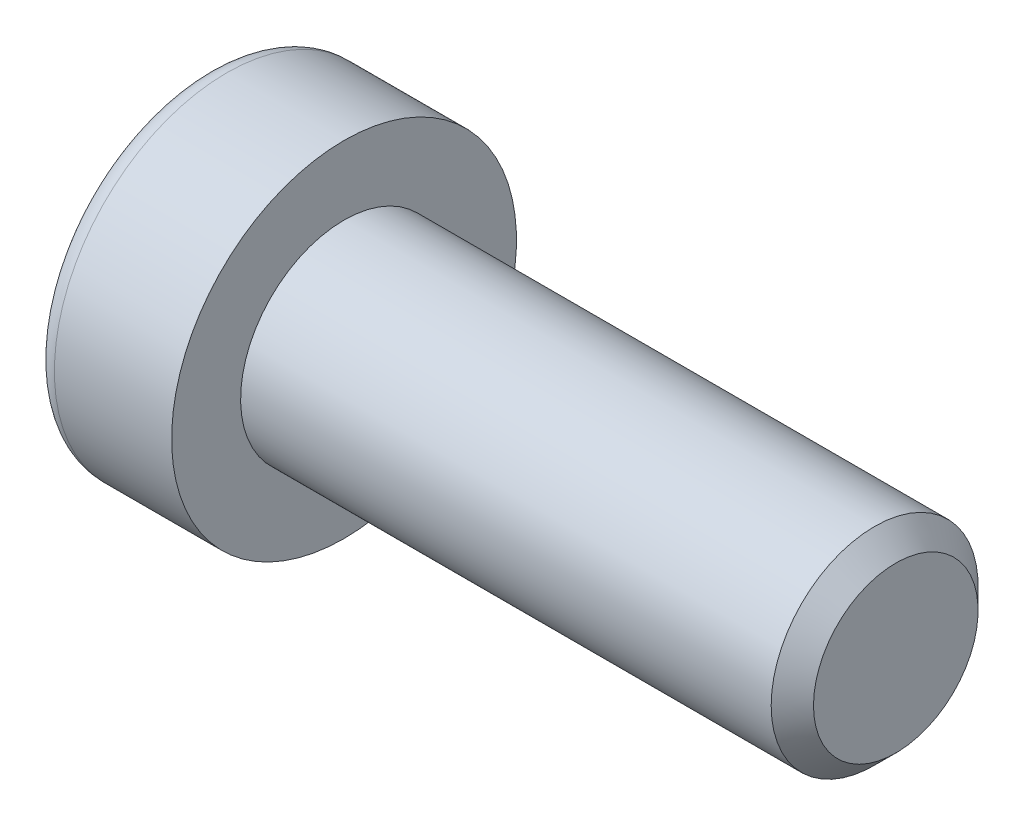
ISO-10303-21;
HEADER;
FILE_DESCRIPTION(('STEP AP214'),'2;1');
FILE_NAME('part.step','',(''),(''),'','','');
FILE_SCHEMA(('AUTOMOTIVE_DESIGN { 1 0 10303 214 1 1 1 1 }'));
ENDSEC;
DATA;
#1=APPLICATION_CONTEXT('core data for automotive mechanical design processes');
#2=APPLICATION_PROTOCOL_DEFINITION('international standard','automotive_design',2000,#1);
#3=PRODUCT_CONTEXT('',#1,'mechanical');
#4=PRODUCT('Part','Part','',(#3));
#5=PRODUCT_RELATED_PRODUCT_CATEGORY('part','',(#4));
#6=PRODUCT_DEFINITION_FORMATION('','',#4);
#7=PRODUCT_DEFINITION_CONTEXT('part definition',#1,'design');
#8=PRODUCT_DEFINITION('design','',#6,#7);
#9=PRODUCT_DEFINITION_SHAPE('','',#8);
#10=(LENGTH_UNIT() NAMED_UNIT(*) SI_UNIT(.MILLI.,.METRE.));
#11=(NAMED_UNIT(*) PLANE_ANGLE_UNIT() SI_UNIT($,.RADIAN.));
#12=(NAMED_UNIT(*) SI_UNIT($,.STERADIAN.) SOLID_ANGLE_UNIT());
#13=UNCERTAINTY_MEASURE_WITH_UNIT(LENGTH_MEASURE(1.E-05),#10,'distance_accuracy_value','');
#14=(GEOMETRIC_REPRESENTATION_CONTEXT(3) GLOBAL_UNCERTAINTY_ASSIGNED_CONTEXT((#13)) GLOBAL_UNIT_ASSIGNED_CONTEXT((#10,
#11,#12)) REPRESENTATION_CONTEXT('',''));
#15=CARTESIAN_POINT('',(0.,0.,0.));
#16=DIRECTION('',(0.,0.,1.));
#17=DIRECTION('',(1.,0.,0.));
#18=AXIS2_PLACEMENT_3D('',#15,#16,#17);
#19=CARTESIAN_POINT('',(-1.00800000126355,0.,0.));
#20=DIRECTION('',(-1.,0.,0.));
#21=DIRECTION('',(0.,0.,1.));
#22=AXIS2_PLACEMENT_3D('',#19,#20,#21);
#23=CONICAL_SURFACE('',#22,2.32325748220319,1.04719754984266);
#24=CARTESIAN_POINT('',(0.333333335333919,-2.27373675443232E-10,0.));
#25=VERTEX_POINT('',#24);
#26=VERTEX_LOOP('',#25);
#27=FACE_BOUND('',#26,.T.);
#28=CARTESIAN_POINT('',(-1.00000000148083,2.00000000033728,1.15470053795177));
#29=CARTESIAN_POINT('',(-0.970695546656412,2.00000000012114,1.05321634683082));
#30=CARTESIAN_POINT('',(-0.944044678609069,2.00000000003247,0.950856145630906));
#31=CARTESIAN_POINT('',(-0.897526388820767,1.99999999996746,0.744363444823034));
#32=CARTESIAN_POINT('',(-0.877675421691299,1.99999999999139,0.640227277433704));
#33=CARTESIAN_POINT('',(-0.84677596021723,2.0000000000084,0.43324544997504));
#34=CARTESIAN_POINT('',(-0.835521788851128,2.00000000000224,0.330431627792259));
#35=CARTESIAN_POINT('',(-0.822089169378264,1.99999999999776,0.124320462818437));
#36=CARTESIAN_POINT('',(-0.819899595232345,1.99999999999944,0.0210238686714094));
#37=CARTESIAN_POINT('',(-0.824466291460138,2.00000000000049,-0.171974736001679));
#38=CARTESIAN_POINT('',(-0.830101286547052,2.00000000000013,-0.261705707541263));
#39=CARTESIAN_POINT('',(-0.847957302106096,1.99999999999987,-0.440583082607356));
#40=CARTESIAN_POINT('',(-0.86018441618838,1.99999999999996,-0.529728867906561));
#41=CARTESIAN_POINT('',(-0.890749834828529,2.00000000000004,-0.708974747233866));
#42=CARTESIAN_POINT('',(-0.909217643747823,2.00000000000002,-0.799052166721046));
#43=CARTESIAN_POINT('',(-0.95113176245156,1.99999999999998,-0.977863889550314));
#44=CARTESIAN_POINT('',(-0.974568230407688,1.99999999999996,-1.06660048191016));
#45=CARTESIAN_POINT('',(-1.00000000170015,2.,-1.15470053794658));
#46=B_SPLINE_CURVE_WITH_KNOTS('',3,(#28,#29,#30,#31,#32,#33,#34,#35,#36,#37,#38,#39,#40,#41,#42,
#43,#44,#45),.UNSPECIFIED.,.F.,.F.,(4,2,2,2,2,2,2,2,4),(0.,0.317016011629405,0.634793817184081,
0.944707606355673,1.25424088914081,1.52370778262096,1.79342419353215,2.06912162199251,
2.34427797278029),.UNSPECIFIED.);
#47=CARTESIAN_POINT('',(-1.00000000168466,1.99999999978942,1.15470053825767));
#48=VERTEX_POINT('',#47);
#49=CARTESIAN_POINT('',(-1.00000000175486,2.,-1.15470053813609));
#50=VERTEX_POINT('',#49);
#51=EDGE_CURVE('E20',#48,#50,#46,.T.);
#52=ORIENTED_EDGE('',*,*,#51,.T.);
#53=CARTESIAN_POINT('',(-1.00000000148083,1.99999999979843,-1.15470053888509));
#54=CARTESIAN_POINT('',(-0.970695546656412,1.91211211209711,-1.20544263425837));
#55=CARTESIAN_POINT('',(-0.94404467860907,1.82346557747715,-1.25662273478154));
#56=CARTESIAN_POINT('',(-0.897526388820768,1.64463765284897,-1.35986908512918));
#57=CARTESIAN_POINT('',(-0.877675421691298,1.55445308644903,-1.41193716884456));
#58=CARTESIAN_POINT('',(-0.84677596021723,1.37520156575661,-1.51542808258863));
#59=CARTESIAN_POINT('',(-0.835521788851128,1.28616218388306,-1.56683499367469));
#60=CARTESIAN_POINT('',(-0.822089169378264,1.10766467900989,-1.66989057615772));
#61=CARTESIAN_POINT('',(-0.819899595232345,1.01820720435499,-1.72153887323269));
#62=CARTESIAN_POINT('',(-0.824466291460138,0.851065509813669,-1.81803817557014));
#63=CARTESIAN_POINT('',(-0.830101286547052,0.773356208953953,-1.86290366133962));
#64=CARTESIAN_POINT('',(-0.847957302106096,0.618443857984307,-1.95234234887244));
#65=CARTESIAN_POINT('',(-0.860184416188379,0.541241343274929,-1.99691524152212));
#66=CARTESIAN_POINT('',(-0.890749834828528,0.386009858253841,-2.08653818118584));
#67=CARTESIAN_POINT('',(-0.909217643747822,0.308000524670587,-2.13157689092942));
#68=CARTESIAN_POINT('',(-0.95113176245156,0.153145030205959,-2.22098275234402));
#69=CARTESIAN_POINT('',(-0.974568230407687,0.076296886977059,-2.26535104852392));
#70=CARTESIAN_POINT('',(-1.00000000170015,3.74709208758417E-10,-2.30940107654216));
#71=B_SPLINE_CURVE_WITH_KNOTS('',3,(#53,#54,#55,#56,#57,#58,#59,#60,#61,#62,#63,#64,#65,#66,#67,
#68,#69,#70),.UNSPECIFIED.,.F.,.F.,(4,2,2,2,2,2,2,2,4),(0.,0.317016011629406,0.634793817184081,
0.944707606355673,1.25424088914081,1.52370778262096,1.79342419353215,2.06912162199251,
2.34427797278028),.UNSPECIFIED.);
#72=CARTESIAN_POINT('',(-1.00000000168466,0.,-2.30940107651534));
#73=VERTEX_POINT('',#72);
#74=EDGE_CURVE('E80',#50,#73,#71,.T.);
#75=ORIENTED_EDGE('',*,*,#74,.T.);
#76=CARTESIAN_POINT('',(-1.00000000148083,-5.38850513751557E-10,-2.30940107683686));
#77=CARTESIAN_POINT('',(-0.970695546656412,-0.0878878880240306,-2.2586589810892));
#78=CARTESIAN_POINT('',(-0.944044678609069,-0.176534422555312,-2.20747888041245));
#79=CARTESIAN_POINT('',(-0.897526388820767,-0.355362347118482,-2.10423252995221));
#80=CARTESIAN_POINT('',(-0.877675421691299,-0.445546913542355,-2.05216444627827));
#81=CARTESIAN_POINT('',(-0.84677596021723,-0.624798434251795,-1.94867353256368));
#82=CARTESIAN_POINT('',(-0.835521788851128,-0.713837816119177,-1.89726662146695));
#83=CARTESIAN_POINT('',(-0.822089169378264,-0.892335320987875,-1.79421103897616));
#84=CARTESIAN_POINT('',(-0.819899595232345,-0.981792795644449,-1.7425627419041));
#85=CARTESIAN_POINT('',(-0.824466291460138,-1.14893449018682,-1.64606343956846));
#86=CARTESIAN_POINT('',(-0.830101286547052,-1.22664379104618,-1.60119795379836));
#87=CARTESIAN_POINT('',(-0.847957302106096,-1.38155614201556,-1.51175926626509));
#88=CARTESIAN_POINT('',(-0.860184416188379,-1.45875865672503,-1.46718637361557));
#89=CARTESIAN_POINT('',(-0.890749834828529,-1.6139901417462,-1.37756343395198));
#90=CARTESIAN_POINT('',(-0.909217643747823,-1.69199947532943,-1.33252472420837));
#91=CARTESIAN_POINT('',(-0.95113176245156,-1.84685496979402,-1.2431188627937));
#92=CARTESIAN_POINT('',(-0.974568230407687,-1.9237031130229,-1.19875056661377));
#93=CARTESIAN_POINT('',(-1.00000000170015,-1.99999999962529,-1.15470053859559));
#94=B_SPLINE_CURVE_WITH_KNOTS('',3,(#76,#77,#78,#79,#80,#81,#82,#83,#84,#85,#86,#87,#88,#89,#90,
#91,#92,#93),.UNSPECIFIED.,.F.,.F.,(4,2,2,2,2,2,2,2,4),(0.,0.317016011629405,0.63479381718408,
0.944707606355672,1.25424088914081,1.52370778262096,1.79342419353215,2.06912162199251,
2.34427797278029),.UNSPECIFIED.);
#95=CARTESIAN_POINT('',(-1.00000000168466,-1.99999999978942,-1.15470053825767));
#96=VERTEX_POINT('',#95);
#97=EDGE_CURVE('E105',#73,#96,#94,.T.);
#98=ORIENTED_EDGE('',*,*,#97,.T.);
#99=CARTESIAN_POINT('',(-1.00000000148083,-2.00000000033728,-1.15470053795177));
#100=CARTESIAN_POINT('',(-0.970695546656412,-2.00000000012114,-1.05321634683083));
#101=CARTESIAN_POINT('',(-0.944044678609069,-2.00000000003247,-0.950856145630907));
#102=CARTESIAN_POINT('',(-0.897526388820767,-1.99999999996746,-0.744363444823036));
#103=CARTESIAN_POINT('',(-0.877675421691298,-1.99999999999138,-0.640227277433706));
#104=CARTESIAN_POINT('',(-0.84677596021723,-2.0000000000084,-0.433245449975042));
#105=CARTESIAN_POINT('',(-0.835521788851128,-2.00000000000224,-0.330431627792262));
#106=CARTESIAN_POINT('',(-0.822089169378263,-1.99999999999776,-0.124320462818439));
#107=CARTESIAN_POINT('',(-0.819899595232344,-1.99999999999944,-0.0210238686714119));
#108=CARTESIAN_POINT('',(-0.824466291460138,-2.00000000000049,0.171974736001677));
#109=CARTESIAN_POINT('',(-0.830101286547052,-2.00000000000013,0.26170570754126));
#110=CARTESIAN_POINT('',(-0.847957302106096,-1.99999999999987,0.440583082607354));
#111=CARTESIAN_POINT('',(-0.860184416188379,-1.99999999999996,0.529728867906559));
#112=CARTESIAN_POINT('',(-0.890749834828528,-2.00000000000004,0.708974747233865));
#113=CARTESIAN_POINT('',(-0.909217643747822,-2.00000000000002,0.799052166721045));
#114=CARTESIAN_POINT('',(-0.951131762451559,-1.99999999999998,0.977863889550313));
#115=CARTESIAN_POINT('',(-0.974568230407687,-1.99999999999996,1.06660048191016));
#116=CARTESIAN_POINT('',(-1.00000000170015,-2.,1.15470053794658));
#117=B_SPLINE_CURVE_WITH_KNOTS('',3,(#99,#100,#101,#102,#103,#104,#105,#106,#107,#108,#109,#110,
#111,#112,#113,#114,#115,#116),.UNSPECIFIED.,.F.,.F.,(4,2,2,2,2,2,2,2,4),(0.,0.317016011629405,
0.63479381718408,0.944707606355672,1.25424088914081,1.52370778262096,1.79342419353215,
2.06912162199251,2.34427797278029),.UNSPECIFIED.);
#118=CARTESIAN_POINT('',(-1.00000000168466,-1.99999999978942,1.15470053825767));
#119=VERTEX_POINT('',#118);
#120=EDGE_CURVE('E129',#96,#119,#117,.T.);
#121=ORIENTED_EDGE('',*,*,#120,.T.);
#122=CARTESIAN_POINT('',(-1.00000000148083,-1.99999999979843,1.15470053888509));
#123=CARTESIAN_POINT('',(-0.970695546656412,-1.91211211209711,1.20544263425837));
#124=CARTESIAN_POINT('',(-0.94404467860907,-1.82346557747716,1.25662273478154));
#125=CARTESIAN_POINT('',(-0.897526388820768,-1.64463765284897,1.35986908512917));
#126=CARTESIAN_POINT('',(-0.877675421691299,-1.55445308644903,1.41193716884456));
#127=CARTESIAN_POINT('',(-0.84677596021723,-1.37520156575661,1.51542808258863));
#128=CARTESIAN_POINT('',(-0.835521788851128,-1.28616218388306,1.56683499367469));
#129=CARTESIAN_POINT('',(-0.822089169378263,-1.10766467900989,1.66989057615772));
#130=CARTESIAN_POINT('',(-0.819899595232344,-1.01820720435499,1.72153887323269));
#131=CARTESIAN_POINT('',(-0.824466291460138,-0.85106550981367,1.81803817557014));
#132=CARTESIAN_POINT('',(-0.830101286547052,-0.773356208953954,1.86290366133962));
#133=CARTESIAN_POINT('',(-0.847957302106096,-0.618443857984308,1.95234234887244));
#134=CARTESIAN_POINT('',(-0.860184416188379,-0.54124134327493,1.99691524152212));
#135=CARTESIAN_POINT('',(-0.890749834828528,-0.386009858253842,2.08653818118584));
#136=CARTESIAN_POINT('',(-0.909217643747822,-0.308000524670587,2.13157689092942));
#137=CARTESIAN_POINT('',(-0.951131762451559,-0.153145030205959,2.22098275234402));
#138=CARTESIAN_POINT('',(-0.974568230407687,-0.076296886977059,2.26535104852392));
#139=CARTESIAN_POINT('',(-1.00000000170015,-3.74708969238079E-10,2.30940107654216));
#140=B_SPLINE_CURVE_WITH_KNOTS('',3,(#122,#123,#124,#125,#126,#127,#128,#129,#130,#131,#132,
#133,#134,#135,#136,#137,#138,#139),.UNSPECIFIED.,.F.,.F.,(4,2,2,2,2,2,2,2,4),(0.,
0.317016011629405,0.63479381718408,0.944707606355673,1.25424088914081,1.52370778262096,
1.79342419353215,2.06912162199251,2.34427797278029),.UNSPECIFIED.);
#141=CARTESIAN_POINT('',(-1.00000000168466,0.,2.30940107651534));
#142=VERTEX_POINT('',#141);
#143=EDGE_CURVE('E137',#119,#142,#140,.T.);
#144=ORIENTED_EDGE('',*,*,#143,.T.);
#145=CARTESIAN_POINT('',(-1.00000000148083,5.38850492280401E-10,2.30940107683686));
#146=CARTESIAN_POINT('',(-0.970695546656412,0.0878878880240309,2.2586589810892));
#147=CARTESIAN_POINT('',(-0.944044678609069,0.176534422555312,2.20747888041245));
#148=CARTESIAN_POINT('',(-0.897526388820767,0.355362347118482,2.10423252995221));
#149=CARTESIAN_POINT('',(-0.877675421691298,0.445546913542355,2.05216444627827));
#150=CARTESIAN_POINT('',(-0.846775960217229,0.624798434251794,1.94867353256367));
#151=CARTESIAN_POINT('',(-0.835521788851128,0.713837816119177,1.89726662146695));
#152=CARTESIAN_POINT('',(-0.822089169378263,0.892335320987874,1.79421103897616));
#153=CARTESIAN_POINT('',(-0.819899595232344,0.981792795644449,1.7425627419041));
#154=CARTESIAN_POINT('',(-0.824466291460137,1.14893449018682,1.64606343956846));
#155=CARTESIAN_POINT('',(-0.830101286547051,1.22664379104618,1.60119795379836));
#156=CARTESIAN_POINT('',(-0.847957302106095,1.38155614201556,1.51175926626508));
#157=CARTESIAN_POINT('',(-0.860184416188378,1.45875865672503,1.46718637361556));
#158=CARTESIAN_POINT('',(-0.890749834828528,1.6139901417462,1.37756343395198));
#159=CARTESIAN_POINT('',(-0.909217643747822,1.69199947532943,1.33252472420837));
#160=CARTESIAN_POINT('',(-0.951131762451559,1.84685496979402,1.2431188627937));
#161=CARTESIAN_POINT('',(-0.974568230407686,1.9237031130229,1.19875056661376));
#162=CARTESIAN_POINT('',(-1.00000000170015,1.99999999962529,1.15470053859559));
#163=B_SPLINE_CURVE_WITH_KNOTS('',3,(#145,#146,#147,#148,#149,#150,#151,#152,#153,#154,#155,
#156,#157,#158,#159,#160,#161,#162),.UNSPECIFIED.,.F.,.F.,(4,2,2,2,2,2,2,2,4),(0.,
0.317016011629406,0.63479381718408,0.944707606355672,1.25424088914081,1.52370778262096,
1.79342419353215,2.06912162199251,2.34427797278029),.UNSPECIFIED.);
#164=EDGE_CURVE('E82',#142,#48,#163,.T.);
#165=ORIENTED_EDGE('',*,*,#164,.T.);
#166=EDGE_LOOP('',(#52,#75,#98,#121,#144,#165));
#167=FACE_BOUND('',#166,.T.);
#168=ADVANCED_FACE('F16',(#27,#167),#23,.F.);
#169=CARTESIAN_POINT('',(-3.99999999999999,2.,1.15470053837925));
#170=DIRECTION('',(0.,1.,0.));
#171=DIRECTION('',(0.,0.,1.));
#172=AXIS2_PLACEMENT_3D('',#169,#170,#171);
#173=PLANE('',#172);
#174=DIRECTION('',(1.,0.,0.));
#175=VECTOR('',#174,1.);
#176=CARTESIAN_POINT('',(-3.99999999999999,2.,1.15470053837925));
#177=LINE('',#176,#175);
#178=CARTESIAN_POINT('',(-3.99999999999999,2.,1.15470053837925));
#179=VERTEX_POINT('',#178);
#180=EDGE_CURVE('E84',#48,#179,#177,.F.);
#181=ORIENTED_EDGE('',*,*,#180,.T.);
#182=DIRECTION('',(0.,0.,1.));
#183=VECTOR('',#182,1.);
#184=CARTESIAN_POINT('',(-3.99999999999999,2.,0.));
#185=LINE('',#184,#183);
#186=CARTESIAN_POINT('',(-3.99999999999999,2.,-1.15470053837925));
#187=VERTEX_POINT('',#186);
#188=EDGE_CURVE('E89',#187,#179,#185,.T.);
#189=ORIENTED_EDGE('',*,*,#188,.F.);
#190=DIRECTION('',(1.,0.,0.));
#191=VECTOR('',#190,1.);
#192=CARTESIAN_POINT('',(-3.99999999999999,2.,-1.15470053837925));
#193=LINE('',#192,#191);
#194=EDGE_CURVE('E87',#187,#50,#193,.T.);
#195=ORIENTED_EDGE('',*,*,#194,.T.);
#196=ORIENTED_EDGE('',*,*,#51,.F.);
#197=EDGE_LOOP('',(#181,#189,#195,#196));
#198=FACE_BOUND('',#197,.T.);
#199=ADVANCED_FACE('F76',(#198),#173,.F.);
#200=CARTESIAN_POINT('',(-3.99999999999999,0.,2.3094010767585));
#201=DIRECTION('',(0.,0.500000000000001,0.866025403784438));
#202=DIRECTION('',(0.,-0.866025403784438,0.500000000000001));
#203=AXIS2_PLACEMENT_3D('',#200,#201,#202);
#204=PLANE('',#203);
#205=DIRECTION('',(1.,0.,0.));
#206=VECTOR('',#205,1.);
#207=CARTESIAN_POINT('',(-3.99999999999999,0.,2.3094010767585));
#208=LINE('',#207,#206);
#209=CARTESIAN_POINT('',(-3.99999999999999,0.,2.3094010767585));
#210=VERTEX_POINT('',#209);
#211=EDGE_CURVE('E141',#142,#210,#208,.F.);
#212=ORIENTED_EDGE('',*,*,#211,.T.);
#213=DIRECTION('',(0.,-0.866025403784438,0.500000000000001));
#214=VECTOR('',#213,1.);
#215=CARTESIAN_POINT('',(-3.99999999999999,2.,1.15470053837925));
#216=LINE('',#215,#214);
#217=EDGE_CURVE('E95',#179,#210,#216,.T.);
#218=ORIENTED_EDGE('',*,*,#217,.F.);
#219=ORIENTED_EDGE('',*,*,#180,.F.);
#220=ORIENTED_EDGE('',*,*,#164,.F.);
#221=EDGE_LOOP('',(#212,#218,#219,#220));
#222=FACE_BOUND('',#221,.T.);
#223=ADVANCED_FACE('F145',(#222),#204,.F.);
#224=CARTESIAN_POINT('',(-3.99999999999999,-2.,1.15470053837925));
#225=DIRECTION('',(0.,-0.5,0.866025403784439));
#226=DIRECTION('',(0.,-0.866025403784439,-0.5));
#227=AXIS2_PLACEMENT_3D('',#224,#225,#226);
#228=PLANE('',#227);
#229=DIRECTION('',(1.,0.,0.));
#230=VECTOR('',#229,1.);
#231=CARTESIAN_POINT('',(-3.99999999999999,-2.,1.15470053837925));
#232=LINE('',#231,#230);
#233=CARTESIAN_POINT('',(-3.99999999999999,-2.,1.15470053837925));
#234=VERTEX_POINT('',#233);
#235=EDGE_CURVE('E136',#119,#234,#232,.F.);
#236=ORIENTED_EDGE('',*,*,#235,.T.);
#237=DIRECTION('',(0.,-0.866025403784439,-0.5));
#238=VECTOR('',#237,1.);
#239=CARTESIAN_POINT('',(-3.99999999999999,0.,2.3094010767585));
#240=LINE('',#239,#238);
#241=EDGE_CURVE('E224',#210,#234,#240,.T.);
#242=ORIENTED_EDGE('',*,*,#241,.F.);
#243=ORIENTED_EDGE('',*,*,#211,.F.);
#244=ORIENTED_EDGE('',*,*,#143,.F.);
#245=EDGE_LOOP('',(#236,#242,#243,#244));
#246=FACE_BOUND('',#245,.T.);
#247=ADVANCED_FACE('F125',(#246),#228,.F.);
#248=CARTESIAN_POINT('',(-3.99999999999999,-2.,-1.15470053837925));
#249=DIRECTION('',(0.,-1.,0.));
#250=DIRECTION('',(0.,0.,-1.));
#251=AXIS2_PLACEMENT_3D('',#248,#249,#250);
#252=PLANE('',#251);
#253=DIRECTION('',(1.,0.,0.));
#254=VECTOR('',#253,1.);
#255=CARTESIAN_POINT('',(-3.99999999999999,-2.,-1.15470053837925));
#256=LINE('',#255,#254);
#257=CARTESIAN_POINT('',(-3.99999999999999,-2.,-1.15470053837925));
#258=VERTEX_POINT('',#257);
#259=EDGE_CURVE('E135',#96,#258,#256,.F.);
#260=ORIENTED_EDGE('',*,*,#259,.T.);
#261=DIRECTION('',(0.,0.,1.));
#262=VECTOR('',#261,1.);
#263=CARTESIAN_POINT('',(-3.99999999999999,-2.,0.));
#264=LINE('',#263,#262);
#265=EDGE_CURVE('E221',#234,#258,#264,.F.);
#266=ORIENTED_EDGE('',*,*,#265,.F.);
#267=ORIENTED_EDGE('',*,*,#235,.F.);
#268=ORIENTED_EDGE('',*,*,#120,.F.);
#269=EDGE_LOOP('',(#260,#266,#267,#268));
#270=FACE_BOUND('',#269,.T.);
#271=ADVANCED_FACE('F121',(#270),#252,.F.);
#272=CARTESIAN_POINT('',(-3.99999999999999,0.,-2.3094010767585));
#273=DIRECTION('',(0.,-0.5,-0.866025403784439));
#274=DIRECTION('',(0.,0.866025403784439,-0.5));
#275=AXIS2_PLACEMENT_3D('',#272,#273,#274);
#276=PLANE('',#275);
#277=DIRECTION('',(1.,0.,0.));
#278=VECTOR('',#277,1.);
#279=CARTESIAN_POINT('',(-3.99999999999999,0.,-2.3094010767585));
#280=LINE('',#279,#278);
#281=CARTESIAN_POINT('',(-3.99999999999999,0.,-2.3094010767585));
#282=VERTEX_POINT('',#281);
#283=EDGE_CURVE('E38',#73,#282,#280,.F.);
#284=ORIENTED_EDGE('',*,*,#283,.T.);
#285=DIRECTION('',(0.,0.866025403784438,-0.5));
#286=VECTOR('',#285,1.);
#287=CARTESIAN_POINT('',(-3.99999999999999,-2.,-1.15470053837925));
#288=LINE('',#287,#286);
#289=EDGE_CURVE('E218',#258,#282,#288,.T.);
#290=ORIENTED_EDGE('',*,*,#289,.F.);
#291=ORIENTED_EDGE('',*,*,#259,.F.);
#292=ORIENTED_EDGE('',*,*,#97,.F.);
#293=EDGE_LOOP('',(#284,#290,#291,#292));
#294=FACE_BOUND('',#293,.T.);
#295=ADVANCED_FACE('F115',(#294),#276,.F.);
#296=CARTESIAN_POINT('',(-3.99999999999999,2.,-1.15470053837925));
#297=DIRECTION('',(0.,0.5,-0.866025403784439));
#298=DIRECTION('',(0.,0.866025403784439,0.5));
#299=AXIS2_PLACEMENT_3D('',#296,#297,#298);
#300=PLANE('',#299);
#301=ORIENTED_EDGE('',*,*,#194,.F.);
#302=DIRECTION('',(0.,0.866025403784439,0.5));
#303=VECTOR('',#302,1.);
#304=CARTESIAN_POINT('',(-3.99999999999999,0.,-2.3094010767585));
#305=LINE('',#304,#303);
#306=EDGE_CURVE('E216',#282,#187,#305,.T.);
#307=ORIENTED_EDGE('',*,*,#306,.F.);
#308=ORIENTED_EDGE('',*,*,#283,.F.);
#309=ORIENTED_EDGE('',*,*,#74,.F.);
#310=EDGE_LOOP('',(#301,#307,#308,#309));
#311=FACE_BOUND('',#310,.T.);
#312=ADVANCED_FACE('F93',(#311),#300,.F.);
#313=CARTESIAN_POINT('',(-3.99999999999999,3.65470053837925,0.));
#314=DIRECTION('',(-1.,0.,0.));
#315=DIRECTION('',(0.,0.,1.));
#316=AXIS2_PLACEMENT_3D('',#313,#314,#315);
#317=PLANE('',#316);
#318=ORIENTED_EDGE('',*,*,#289,.T.);
#319=ORIENTED_EDGE('',*,*,#306,.T.);
#320=ORIENTED_EDGE('',*,*,#188,.T.);
#321=ORIENTED_EDGE('',*,*,#217,.T.);
#322=ORIENTED_EDGE('',*,*,#241,.T.);
#323=ORIENTED_EDGE('',*,*,#265,.T.);
#324=EDGE_LOOP('',(#318,#319,#320,#321,#322,#323));
#325=FACE_BOUND('',#324,.T.);
#326=CARTESIAN_POINT('',(-3.99999999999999,0.,0.));
#327=DIRECTION('',(1.,0.,0.));
#328=DIRECTION('',(0.,1.,0.));
#329=AXIS2_PLACEMENT_3D('',#326,#327,#328);
#330=CIRCLE('',#329,4.4);
#331=CARTESIAN_POINT('',(-3.99999999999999,4.4,0.));
#332=VERTEX_POINT('',#331);
#333=EDGE_CURVE('E193',#332,#332,#330,.T.);
#334=ORIENTED_EDGE('',*,*,#333,.F.);
#335=EDGE_LOOP('',(#334));
#336=FACE_BOUND('',#335,.T.);
#337=ADVANCED_FACE('F114',(#325,#336),#317,.T.);
#338=CARTESIAN_POINT('',(-3.4,0.,0.));
#339=DIRECTION('',(1.,0.,0.));
#340=DIRECTION('',(0.,0.,-1.));
#341=AXIS2_PLACEMENT_3D('',#338,#339,#340);
#342=TOROIDAL_SURFACE('',#341,4.4,0.6);
#343=CARTESIAN_POINT('',(-3.4,0.,0.));
#344=DIRECTION('',(1.,0.,0.));
#345=DIRECTION('',(0.,1.,0.));
#346=AXIS2_PLACEMENT_3D('',#343,#344,#345);
#347=CIRCLE('',#346,5.);
#348=CARTESIAN_POINT('',(-3.4,5.,0.));
#349=VERTEX_POINT('',#348);
#350=EDGE_CURVE('E234',#349,#349,#347,.T.);
#351=ORIENTED_EDGE('',*,*,#350,.F.);
#352=EDGE_LOOP('',(#351));
#353=FACE_BOUND('',#352,.T.);
#354=ORIENTED_EDGE('',*,*,#333,.T.);
#355=EDGE_LOOP('',(#354));
#356=FACE_BOUND('',#355,.T.);
#357=ADVANCED_FACE('F177',(#353,#356),#342,.T.);
#358=CARTESIAN_POINT('',(-2.,0.,0.));
#359=DIRECTION('',(1.,0.,0.));
#360=DIRECTION('',(0.,1.,0.));
#361=AXIS2_PLACEMENT_3D('',#358,#359,#360);
#362=CYLINDRICAL_SURFACE('',#361,5.);
#363=ORIENTED_EDGE('',*,*,#350,.T.);
#364=EDGE_LOOP('',(#363));
#365=FACE_BOUND('',#364,.T.);
#366=CARTESIAN_POINT('',(0.,0.,0.));
#367=DIRECTION('',(1.,0.,0.));
#368=DIRECTION('',(0.,1.,0.));
#369=AXIS2_PLACEMENT_3D('',#366,#367,#368);
#370=CIRCLE('',#369,5.);
#371=CARTESIAN_POINT('',(0.,5.,0.));
#372=VERTEX_POINT('',#371);
#373=EDGE_CURVE('E103',#372,#372,#370,.T.);
#374=ORIENTED_EDGE('',*,*,#373,.F.);
#375=EDGE_LOOP('',(#374));
#376=FACE_BOUND('',#375,.T.);
#377=ADVANCED_FACE('F174',(#365,#376),#362,.T.);
#378=CARTESIAN_POINT('',(16.,1.5,0.));
#379=DIRECTION('',(1.,0.,0.));
#380=DIRECTION('',(0.,0.,-1.));
#381=AXIS2_PLACEMENT_3D('',#378,#379,#380);
#382=PLANE('',#381);
#383=CARTESIAN_POINT('',(16.0000000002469,0.,0.));
#384=DIRECTION('',(-1.,0.,0.));
#385=DIRECTION('',(0.,0.,1.));
#386=AXIS2_PLACEMENT_3D('',#383,#384,#385);
#387=CIRCLE('',#386,2.38655000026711);
#388=CARTESIAN_POINT('',(16.0000000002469,0.,2.38655000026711));
#389=VERTEX_POINT('',#388);
#390=EDGE_CURVE('E230',#389,#389,#387,.T.);
#391=ORIENTED_EDGE('',*,*,#390,.F.);
#392=EDGE_LOOP('',(#391));
#393=FACE_BOUND('',#392,.T.);
#394=ADVANCED_FACE('F170',(#393),#382,.T.);
#395=CARTESIAN_POINT('',(0.,4.,0.));
#396=DIRECTION('',(1.,0.,0.));
#397=DIRECTION('',(0.,0.,-1.));
#398=AXIS2_PLACEMENT_3D('',#395,#396,#397);
#399=PLANE('',#398);
#400=CARTESIAN_POINT('',(0.,0.,0.));
#401=DIRECTION('',(1.,0.,0.));
#402=DIRECTION('',(0.,1.,0.));
#403=AXIS2_PLACEMENT_3D('',#400,#401,#402);
#404=CIRCLE('',#403,3.);
#405=CARTESIAN_POINT('',(0.,3.,0.));
#406=VERTEX_POINT('',#405);
#407=EDGE_CURVE('E29',#406,#406,#404,.T.);
#408=ORIENTED_EDGE('',*,*,#407,.F.);
#409=EDGE_LOOP('',(#408));
#410=FACE_BOUND('',#409,.T.);
#411=ORIENTED_EDGE('',*,*,#373,.T.);
#412=EDGE_LOOP('',(#411));
#413=FACE_BOUND('',#412,.T.);
#414=ADVANCED_FACE('F163',(#410,#413),#399,.T.);
#415=CARTESIAN_POINT('',(15.3865499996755,0.,0.));
#416=DIRECTION('',(-1.,0.,0.));
#417=DIRECTION('',(0.,0.,1.));
#418=AXIS2_PLACEMENT_3D('',#415,#416,#417);
#419=CONICAL_SURFACE('',#418,2.99999999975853,0.785398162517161);
#420=ORIENTED_EDGE('',*,*,#390,.T.);
#421=EDGE_LOOP('',(#420));
#422=FACE_BOUND('',#421,.T.);
#423=CARTESIAN_POINT('',(15.38655,0.,0.));
#424=DIRECTION('',(1.,0.,0.));
#425=DIRECTION('',(0.,1.,0.));
#426=AXIS2_PLACEMENT_3D('',#423,#424,#425);
#427=CIRCLE('',#426,3.);
#428=CARTESIAN_POINT('',(15.38655,3.,0.));
#429=VERTEX_POINT('',#428);
#430=EDGE_CURVE('E11',#429,#429,#427,.F.);
#431=ORIENTED_EDGE('',*,*,#430,.F.);
#432=EDGE_LOOP('',(#431));
#433=FACE_BOUND('',#432,.T.);
#434=ADVANCED_FACE('F156',(#422,#433),#419,.T.);
#435=CARTESIAN_POINT('',(9.5,0.,0.));
#436=DIRECTION('',(1.,0.,0.));
#437=DIRECTION('',(0.,1.,0.));
#438=AXIS2_PLACEMENT_3D('',#435,#436,#437);
#439=CYLINDRICAL_SURFACE('',#438,3.);
#440=ORIENTED_EDGE('',*,*,#430,.T.);
#441=EDGE_LOOP('',(#440));
#442=FACE_BOUND('',#441,.T.);
#443=ORIENTED_EDGE('',*,*,#407,.T.);
#444=EDGE_LOOP('',(#443));
#445=FACE_BOUND('',#444,.T.);
#446=ADVANCED_FACE('F154',(#442,#445),#439,.T.);
#447=CLOSED_SHELL('',(#168,#199,#223,#247,#271,#295,#312,#337,#357,#377,#394,#414,#434,#446));
#448=MANIFOLD_SOLID_BREP('B1',#447);
#449=ADVANCED_BREP_SHAPE_REPRESENTATION('',(#18,#448),#14);
#450=SHAPE_DEFINITION_REPRESENTATION(#9,#449);
ENDSEC;
END-ISO-10303-21;
